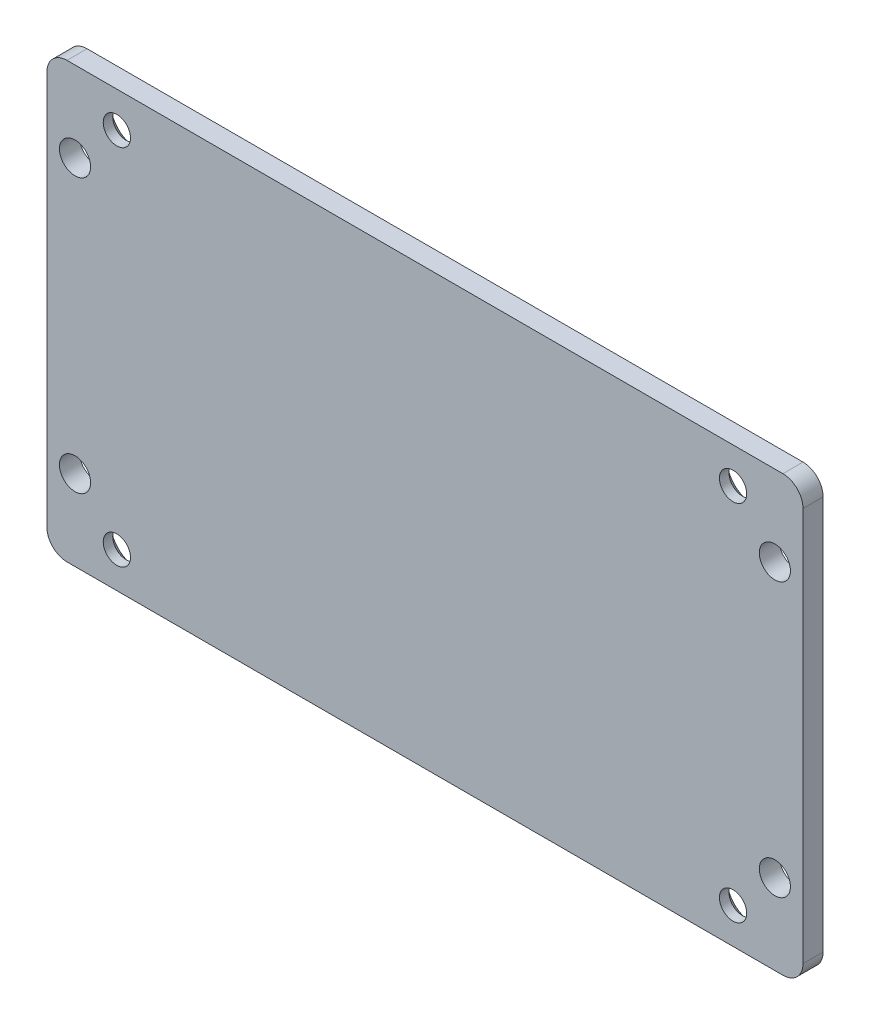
from build123d import *

# Parameters (mm, degrees)
BOSS_EXTRUDE1_DEPTH                               = 3.175
CSK_FOR_6_FLAT_HEAD_MACHINE_SCREW_100_D           = 4.3053
CSK_FOR_6_FLAT_HEAD_MACHINE_SCREW_100_DEPTH       = 6.35
CSK_FOR_6_FLAT_HEAD_MACHINE_SCREW_100_CSINK_D     = 8.297418
CSK_FOR_6_FLAT_HEAD_MACHINE_SCREW_100_CSINK_ANGLE = 100
CSK_FOR_6_FLAT_HEAD_MACHINE_SCREW_100_TIP         = 1.293442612
F_10_0_1935_DIAMETER_HOLE1_D                      = 4.9149


with BuildPart() as part:
    # Sketch1 → Boss-Extrude1 (new body)
    with BuildSketch(Plane.XY):
        with BuildLine():
            Line((-56.515, -34.29), (56.515, -34.29))
            ThreePointArc((56.515, -34.29), (58.76006403, -33.36006403), (59.69, -31.115))
            Line((59.69, -31.115), (59.69, 31.115))
            ThreePointArc((59.69, 31.115), (58.76006403, 33.36006403), (56.515, 34.29))
            Line((56.515, 34.29), (-56.515, 34.29))
            ThreePointArc((-56.515, 34.29), (-58.76006403, 33.36006403), (-59.69, 31.115))
            Line((-59.69, 31.115), (-59.69, -31.115))
            ThreePointArc((-59.69, -31.115), (-58.76006403, -33.36006403), (-56.515, -34.29))
        make_face()
    extrude(amount=BOSS_EXTRUDE1_DEPTH)

    # CSK for _6 Flat Head Machine Screw _100
    with Locations(Plane(origin=(0, 0, 0), x_dir=(-1, 0, 0), z_dir=(0, 0, -1))):
        with Locations((-48.641, -28.6766), (-48.641, 28.6766), (48.641, 28.6766), (48.641, -28.6766)):
            CounterSinkHole(CSK_FOR_6_FLAT_HEAD_MACHINE_SCREW_100_D / 2, CSK_FOR_6_FLAT_HEAD_MACHINE_SCREW_100_CSINK_D / 2, depth=CSK_FOR_6_FLAT_HEAD_MACHINE_SCREW_100_DEPTH, counter_sink_angle=CSK_FOR_6_FLAT_HEAD_MACHINE_SCREW_100_CSINK_ANGLE)
            with Locations((0, 0, -(CSK_FOR_6_FLAT_HEAD_MACHINE_SCREW_100_DEPTH + CSK_FOR_6_FLAT_HEAD_MACHINE_SCREW_100_TIP / 2))):  # 118° drill point
                Cone(0, CSK_FOR_6_FLAT_HEAD_MACHINE_SCREW_100_D / 2, CSK_FOR_6_FLAT_HEAD_MACHINE_SCREW_100_TIP, mode=Mode.SUBTRACT)

    # 10 _0.1935_ Diameter Hole1 (through all)
    with Locations(Plane.XY.offset(3.175)):
        with Locations((-55.245, -21.59), (55.245, -21.59), (55.245, 21.59), (-55.245, 21.59)):
            Hole(F_10_0_1935_DIAMETER_HOLE1_D / 2)


solid = part.part
